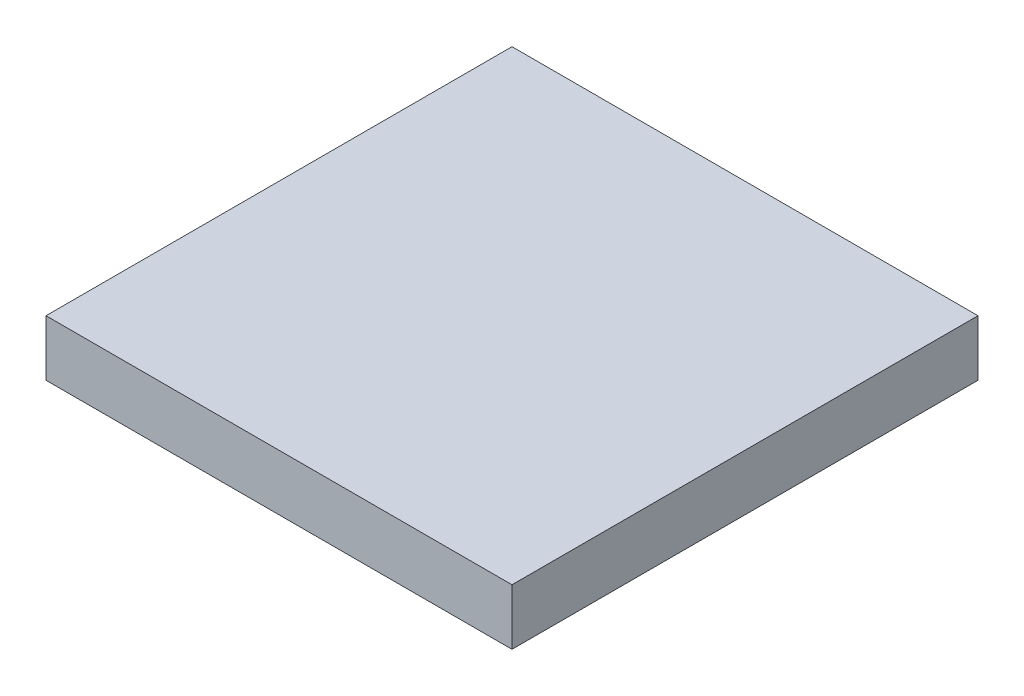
from build123d import *

# Parameters (mm, degrees)
ESQUISSE1_W        = 100
ESQUISSE1_H        = 100
BOSS_EXTRU_1_DEPTH = 12


with BuildPart() as part:
    # Esquisse1 → Boss.-Extru.1 (new body)
    with BuildSketch(Plane(origin=(0, 0, 0), x_dir=(1, 0, 0), z_dir=(0, 1, 0))):
        with Locations((50, 50)):
            Rectangle(ESQUISSE1_W, ESQUISSE1_H)
    extrude(amount=BOSS_EXTRU_1_DEPTH)


solid = part.part
